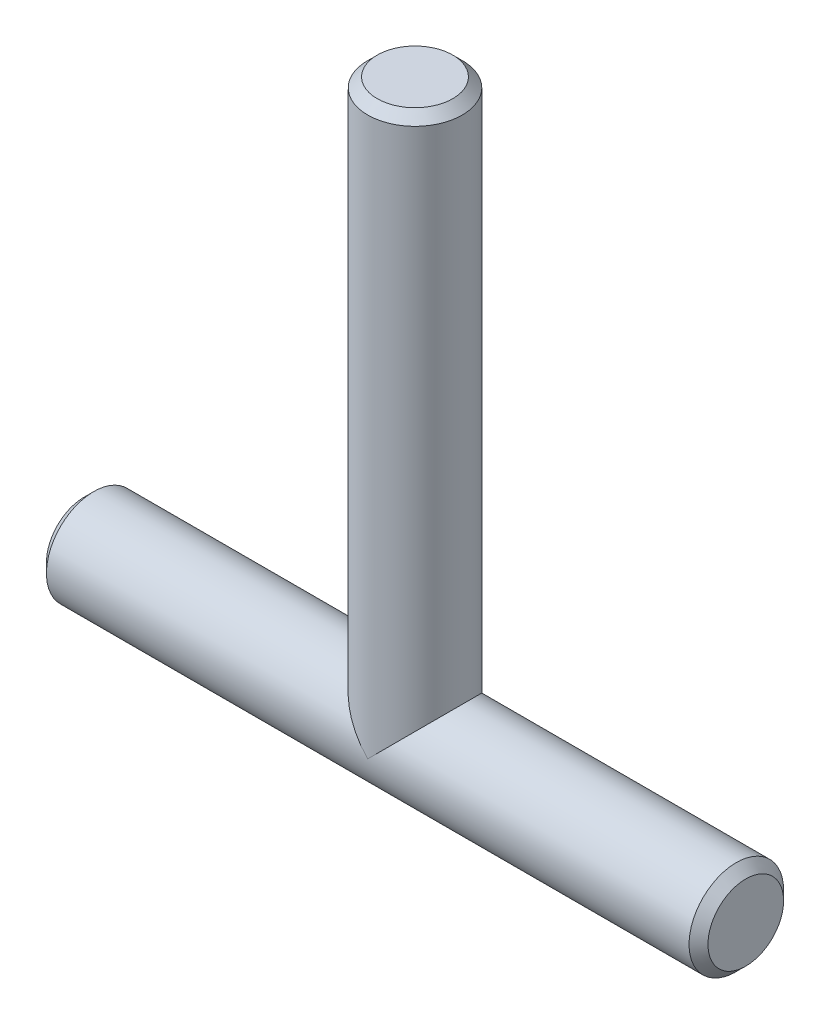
from build123d import *

# Parameters (mm, degrees)
SKETCH1_R           = 5
BOSS_EXTRUDE1_DEPTH = 35
SKETCH2_R           = 5
BOSS_EXTRUDE2_DEPTH = 60
CHAMFER1_SIZE       = 1


with BuildPart() as part:
    # Sketch1 → Boss-Extrude1 (new, symmetric)
    with BuildSketch(Plane(origin=(0, 0, 0), x_dir=(0, 0, -1), z_dir=(1, 0, 0))):
        Circle(SKETCH1_R)
    extrude(amount=BOSS_EXTRUDE1_DEPTH, both=True)

    # Sketch2 → Boss-Extrude2 (add)
    with BuildSketch(Plane(origin=(0, 0, 0), x_dir=(1, 0, 0), z_dir=(0, 1, 0))):
        with Locations(Location((0, 0, 0), (0, 0, 270))):
            Circle(SKETCH2_R)
    extrude(amount=BOSS_EXTRUDE2_DEPTH)

    # Chamfer1
    chamfer1_edges = [part.edges().sort_by_distance(p)[0] for p in [
        (-35, 0, 5),
        (35, 0, 5),
        (0, 60, -5),
    ]]
    chamfer(chamfer1_edges, length=CHAMFER1_SIZE)


solid = part.part
